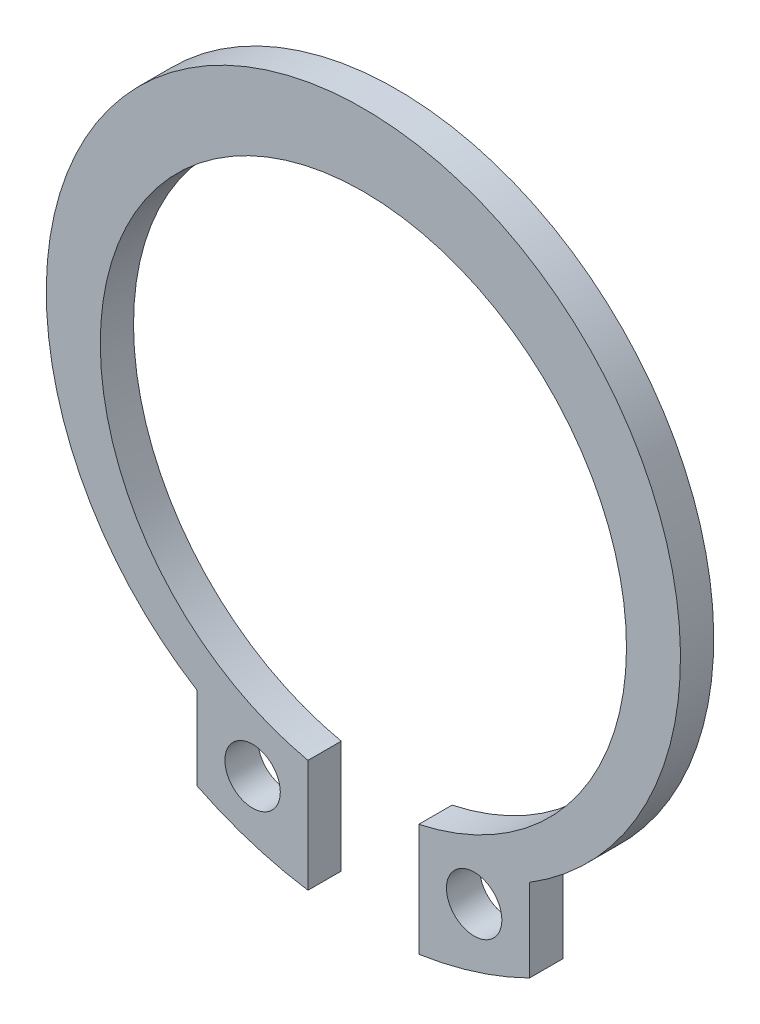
ISO-10303-21;
HEADER;
FILE_DESCRIPTION(('STEP AP214'),'2;1');
FILE_NAME('part.step','',(''),(''),'','','');
FILE_SCHEMA(('AUTOMOTIVE_DESIGN { 1 0 10303 214 1 1 1 1 }'));
ENDSEC;
DATA;
#1=APPLICATION_CONTEXT('core data for automotive mechanical design processes');
#2=APPLICATION_PROTOCOL_DEFINITION('international standard','automotive_design',2000,#1);
#3=PRODUCT_CONTEXT('',#1,'mechanical');
#4=PRODUCT('Part','Part','',(#3));
#5=PRODUCT_RELATED_PRODUCT_CATEGORY('part','',(#4));
#6=PRODUCT_DEFINITION_FORMATION('','',#4);
#7=PRODUCT_DEFINITION_CONTEXT('part definition',#1,'design');
#8=PRODUCT_DEFINITION('design','',#6,#7);
#9=PRODUCT_DEFINITION_SHAPE('','',#8);
#10=(LENGTH_UNIT() NAMED_UNIT(*) SI_UNIT(.MILLI.,.METRE.));
#11=(NAMED_UNIT(*) PLANE_ANGLE_UNIT() SI_UNIT($,.RADIAN.));
#12=(NAMED_UNIT(*) SI_UNIT($,.STERADIAN.) SOLID_ANGLE_UNIT());
#13=UNCERTAINTY_MEASURE_WITH_UNIT(LENGTH_MEASURE(1.E-05),#10,'distance_accuracy_value','');
#14=(GEOMETRIC_REPRESENTATION_CONTEXT(3) GLOBAL_UNCERTAINTY_ASSIGNED_CONTEXT((#13)) GLOBAL_UNIT_ASSIGNED_CONTEXT((#10,
#11,#12)) REPRESENTATION_CONTEXT('',''));
#15=CARTESIAN_POINT('',(0.,0.,0.));
#16=DIRECTION('',(0.,0.,1.));
#17=DIRECTION('',(1.,0.,0.));
#18=AXIS2_PLACEMENT_3D('',#15,#16,#17);
#19=CARTESIAN_POINT('',(-4.,-10.7819293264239,35.4368941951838));
#20=DIRECTION('',(0.,0.,-1.));
#21=DIRECTION('',(-1.,0.,0.));
#22=AXIS2_PLACEMENT_3D('',#19,#20,#21);
#23=CYLINDRICAL_SURFACE('',#22,1.);
#24=CARTESIAN_POINT('',(-4.,-10.7819293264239,0.));
#25=DIRECTION('',(0.,0.,1.));
#26=DIRECTION('',(1.,0.,0.));
#27=AXIS2_PLACEMENT_3D('',#24,#25,#26);
#28=CIRCLE('',#27,1.);
#29=CARTESIAN_POINT('',(-3.,-10.7819293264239,0.));
#30=VERTEX_POINT('',#29);
#31=EDGE_CURVE('E141',#30,#30,#28,.T.);
#32=ORIENTED_EDGE('',*,*,#31,.F.);
#33=EDGE_LOOP('',(#32));
#34=FACE_BOUND('',#33,.T.);
#35=CARTESIAN_POINT('',(-4.,-10.7819293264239,1.2));
#36=DIRECTION('',(0.,0.,1.));
#37=DIRECTION('',(1.,0.,0.));
#38=AXIS2_PLACEMENT_3D('',#35,#36,#37);
#39=CIRCLE('',#38,1.);
#40=CARTESIAN_POINT('',(-3.,-10.7819293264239,1.2));
#41=VERTEX_POINT('',#40);
#42=EDGE_CURVE('E121',#41,#41,#39,.T.);
#43=ORIENTED_EDGE('',*,*,#42,.T.);
#44=EDGE_LOOP('',(#43));
#45=FACE_BOUND('',#44,.T.);
#46=ADVANCED_FACE('F36',(#34,#45),#23,.F.);
#47=CARTESIAN_POINT('',(-2.,-13.3510299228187,35.4368941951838));
#48=DIRECTION('',(-1.,0.,0.));
#49=DIRECTION('',(0.,-1.,0.));
#50=AXIS2_PLACEMENT_3D('',#47,#48,#49);
#51=PLANE('',#50);
#52=DIRECTION('',(0.,1.,0.));
#53=VECTOR('',#52,1.);
#54=CARTESIAN_POINT('',(-2.,-13.3510299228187,1.2));
#55=LINE('',#54,#53);
#56=CARTESIAN_POINT('',(-2.,-13.3510299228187,1.2));
#57=VERTEX_POINT('',#56);
#58=CARTESIAN_POINT('',(-2.,-9.28708781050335,1.2));
#59=VERTEX_POINT('',#58);
#60=EDGE_CURVE('E105',#57,#59,#55,.T.);
#61=ORIENTED_EDGE('',*,*,#60,.F.);
#62=DIRECTION('',(0.,0.,-1.));
#63=VECTOR('',#62,1.);
#64=CARTESIAN_POINT('',(-2.,-13.3510299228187,35.4368941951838));
#65=LINE('',#64,#63);
#66=CARTESIAN_POINT('',(-2.,-13.3510299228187,0.));
#67=VERTEX_POINT('',#66);
#68=EDGE_CURVE('E52',#57,#67,#65,.T.);
#69=ORIENTED_EDGE('',*,*,#68,.T.);
#70=DIRECTION('',(0.,1.,0.));
#71=VECTOR('',#70,1.);
#72=CARTESIAN_POINT('',(-2.,-13.3510299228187,0.));
#73=LINE('',#72,#71);
#74=CARTESIAN_POINT('',(-2.,-9.28708781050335,0.));
#75=VERTEX_POINT('',#74);
#76=EDGE_CURVE('E108',#67,#75,#73,.T.);
#77=ORIENTED_EDGE('',*,*,#76,.T.);
#78=DIRECTION('',(0.,0.,-1.));
#79=VECTOR('',#78,1.);
#80=CARTESIAN_POINT('',(-2.,-9.28708781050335,35.4368941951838));
#81=LINE('',#80,#79);
#82=EDGE_CURVE('E101',#59,#75,#81,.T.);
#83=ORIENTED_EDGE('',*,*,#82,.F.);
#84=EDGE_LOOP('',(#61,#69,#77,#83));
#85=FACE_BOUND('',#84,.T.);
#86=ADVANCED_FACE('F103',(#85),#51,.F.);
#87=CARTESIAN_POINT('',(0.,0.,35.4368941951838));
#88=DIRECTION('',(0.,0.,-1.));
#89=DIRECTION('',(-1.,0.,0.));
#90=AXIS2_PLACEMENT_3D('',#87,#88,#89);
#91=CYLINDRICAL_SURFACE('',#90,13.5);
#92=CARTESIAN_POINT('',(0.,0.,1.2));
#93=DIRECTION('',(0.,0.,1.));
#94=DIRECTION('',(1.,0.,0.));
#95=AXIS2_PLACEMENT_3D('',#92,#93,#94);
#96=CIRCLE('',#95,13.5);
#97=CARTESIAN_POINT('',(-6.,-12.0933866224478,1.2));
#98=VERTEX_POINT('',#97);
#99=EDGE_CURVE('E120',#98,#57,#96,.T.);
#100=ORIENTED_EDGE('',*,*,#99,.F.);
#101=DIRECTION('',(0.,0.,-1.));
#102=VECTOR('',#101,1.);
#103=CARTESIAN_POINT('',(-6.,-12.0933866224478,35.4368941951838));
#104=LINE('',#103,#102);
#105=CARTESIAN_POINT('',(-6.,-12.0933866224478,0.));
#106=VERTEX_POINT('',#105);
#107=EDGE_CURVE('E165',#98,#106,#104,.T.);
#108=ORIENTED_EDGE('',*,*,#107,.T.);
#109=CARTESIAN_POINT('',(0.,0.,0.));
#110=DIRECTION('',(0.,0.,1.));
#111=DIRECTION('',(1.,0.,0.));
#112=AXIS2_PLACEMENT_3D('',#109,#110,#111);
#113=CIRCLE('',#112,13.5);
#114=EDGE_CURVE('E161',#106,#67,#113,.T.);
#115=ORIENTED_EDGE('',*,*,#114,.T.);
#116=ORIENTED_EDGE('',*,*,#68,.F.);
#117=EDGE_LOOP('',(#100,#108,#115,#116));
#118=FACE_BOUND('',#117,.T.);
#119=ADVANCED_FACE('F195',(#118),#91,.T.);
#120=CARTESIAN_POINT('',(-6.,-9.10205106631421,35.4368941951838));
#121=DIRECTION('',(1.,0.,0.));
#122=DIRECTION('',(0.,0.,-1.));
#123=AXIS2_PLACEMENT_3D('',#120,#121,#122);
#124=PLANE('',#123);
#125=DIRECTION('',(0.,-1.,0.));
#126=VECTOR('',#125,1.);
#127=CARTESIAN_POINT('',(-6.,-9.10205106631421,1.2));
#128=LINE('',#127,#126);
#129=CARTESIAN_POINT('',(-6.,-9.10205106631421,1.2));
#130=VERTEX_POINT('',#129);
#131=EDGE_CURVE('E123',#130,#98,#128,.T.);
#132=ORIENTED_EDGE('',*,*,#131,.F.);
#133=DIRECTION('',(0.,0.,-1.));
#134=VECTOR('',#133,1.);
#135=CARTESIAN_POINT('',(-6.,-9.10205106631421,35.4368941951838));
#136=LINE('',#135,#134);
#137=CARTESIAN_POINT('',(-6.,-9.10205106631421,0.));
#138=VERTEX_POINT('',#137);
#139=EDGE_CURVE('E167',#130,#138,#136,.T.);
#140=ORIENTED_EDGE('',*,*,#139,.T.);
#141=DIRECTION('',(0.,-1.,0.));
#142=VECTOR('',#141,1.);
#143=CARTESIAN_POINT('',(-6.,-9.10205106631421,0.));
#144=LINE('',#143,#142);
#145=EDGE_CURVE('E158',#138,#106,#144,.T.);
#146=ORIENTED_EDGE('',*,*,#145,.T.);
#147=ORIENTED_EDGE('',*,*,#107,.F.);
#148=EDGE_LOOP('',(#132,#140,#146,#147));
#149=FACE_BOUND('',#148,.T.);
#150=ADVANCED_FACE('F192',(#149),#124,.F.);
#151=CARTESIAN_POINT('',(0.,0.65,35.4368941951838));
#152=DIRECTION('',(0.,0.,-1.));
#153=DIRECTION('',(-1.,0.,0.));
#154=AXIS2_PLACEMENT_3D('',#151,#152,#153);
#155=CYLINDRICAL_SURFACE('',#154,11.45);
#156=CARTESIAN_POINT('',(0.,0.65,1.2));
#157=DIRECTION('',(0.,0.,1.));
#158=DIRECTION('',(1.,0.,0.));
#159=AXIS2_PLACEMENT_3D('',#156,#157,#158);
#160=CIRCLE('',#159,11.45);
#161=CARTESIAN_POINT('',(6.,-9.1020510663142,1.2));
#162=VERTEX_POINT('',#161);
#163=EDGE_CURVE('E129',#162,#130,#160,.T.);
#164=ORIENTED_EDGE('',*,*,#163,.F.);
#165=DIRECTION('',(0.,0.,-1.));
#166=VECTOR('',#165,1.);
#167=CARTESIAN_POINT('',(6.,-9.1020510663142,35.4368941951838));
#168=LINE('',#167,#166);
#169=CARTESIAN_POINT('',(6.,-9.1020510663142,0.));
#170=VERTEX_POINT('',#169);
#171=EDGE_CURVE('E169',#162,#170,#168,.T.);
#172=ORIENTED_EDGE('',*,*,#171,.T.);
#173=CARTESIAN_POINT('',(0.,0.65,0.));
#174=DIRECTION('',(0.,0.,1.));
#175=DIRECTION('',(1.,0.,0.));
#176=AXIS2_PLACEMENT_3D('',#173,#174,#175);
#177=CIRCLE('',#176,11.45);
#178=EDGE_CURVE('E155',#170,#138,#177,.T.);
#179=ORIENTED_EDGE('',*,*,#178,.T.);
#180=ORIENTED_EDGE('',*,*,#139,.F.);
#181=EDGE_LOOP('',(#164,#172,#179,#180));
#182=FACE_BOUND('',#181,.T.);
#183=ADVANCED_FACE('F190',(#182),#155,.T.);
#184=CARTESIAN_POINT('',(6.,-12.0933866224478,35.4368941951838));
#185=DIRECTION('',(-1.,0.,0.));
#186=DIRECTION('',(0.,-1.,0.));
#187=AXIS2_PLACEMENT_3D('',#184,#185,#186);
#188=PLANE('',#187);
#189=DIRECTION('',(0.,1.,0.));
#190=VECTOR('',#189,1.);
#191=CARTESIAN_POINT('',(6.,-12.0933866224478,1.2));
#192=LINE('',#191,#190);
#193=CARTESIAN_POINT('',(6.,-12.0933866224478,1.2));
#194=VERTEX_POINT('',#193);
#195=EDGE_CURVE('E132',#194,#162,#192,.T.);
#196=ORIENTED_EDGE('',*,*,#195,.F.);
#197=DIRECTION('',(0.,0.,-1.));
#198=VECTOR('',#197,1.);
#199=CARTESIAN_POINT('',(6.,-12.0933866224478,35.4368941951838));
#200=LINE('',#199,#198);
#201=CARTESIAN_POINT('',(6.,-12.0933866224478,0.));
#202=VERTEX_POINT('',#201);
#203=EDGE_CURVE('E171',#194,#202,#200,.T.);
#204=ORIENTED_EDGE('',*,*,#203,.T.);
#205=DIRECTION('',(0.,1.,0.));
#206=VECTOR('',#205,1.);
#207=CARTESIAN_POINT('',(6.,-12.0933866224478,0.));
#208=LINE('',#207,#206);
#209=EDGE_CURVE('E152',#202,#170,#208,.T.);
#210=ORIENTED_EDGE('',*,*,#209,.T.);
#211=ORIENTED_EDGE('',*,*,#171,.F.);
#212=EDGE_LOOP('',(#196,#204,#210,#211));
#213=FACE_BOUND('',#212,.T.);
#214=ADVANCED_FACE('F187',(#213),#188,.F.);
#215=CARTESIAN_POINT('',(0.,0.,35.4368941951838));
#216=DIRECTION('',(0.,0.,-1.));
#217=DIRECTION('',(-1.,0.,0.));
#218=AXIS2_PLACEMENT_3D('',#215,#216,#217);
#219=CYLINDRICAL_SURFACE('',#218,13.5);
#220=CARTESIAN_POINT('',(0.,0.,1.2));
#221=DIRECTION('',(0.,0.,1.));
#222=DIRECTION('',(1.,0.,0.));
#223=AXIS2_PLACEMENT_3D('',#220,#221,#222);
#224=CIRCLE('',#223,13.5);
#225=CARTESIAN_POINT('',(2.,-13.3510299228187,1.2));
#226=VERTEX_POINT('',#225);
#227=EDGE_CURVE('E135',#226,#194,#224,.T.);
#228=ORIENTED_EDGE('',*,*,#227,.F.);
#229=DIRECTION('',(0.,0.,-1.));
#230=VECTOR('',#229,1.);
#231=CARTESIAN_POINT('',(2.,-13.3510299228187,35.4368941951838));
#232=LINE('',#231,#230);
#233=CARTESIAN_POINT('',(2.,-13.3510299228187,0.));
#234=VERTEX_POINT('',#233);
#235=EDGE_CURVE('E45',#226,#234,#232,.T.);
#236=ORIENTED_EDGE('',*,*,#235,.T.);
#237=CARTESIAN_POINT('',(0.,0.,0.));
#238=DIRECTION('',(0.,0.,1.));
#239=DIRECTION('',(1.,0.,0.));
#240=AXIS2_PLACEMENT_3D('',#237,#238,#239);
#241=CIRCLE('',#240,13.5);
#242=EDGE_CURVE('E149',#234,#202,#241,.T.);
#243=ORIENTED_EDGE('',*,*,#242,.T.);
#244=ORIENTED_EDGE('',*,*,#203,.F.);
#245=EDGE_LOOP('',(#228,#236,#243,#244));
#246=FACE_BOUND('',#245,.T.);
#247=ADVANCED_FACE('F174',(#246),#219,.T.);
#248=CARTESIAN_POINT('',(2.,-9.28708781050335,35.4368941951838));
#249=DIRECTION('',(1.,0.,0.));
#250=DIRECTION('',(0.,1.,0.));
#251=AXIS2_PLACEMENT_3D('',#248,#249,#250);
#252=PLANE('',#251);
#253=DIRECTION('',(0.,-1.,0.));
#254=VECTOR('',#253,1.);
#255=CARTESIAN_POINT('',(2.,-9.28708781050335,1.2));
#256=LINE('',#255,#254);
#257=CARTESIAN_POINT('',(2.,-9.28708781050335,1.2));
#258=VERTEX_POINT('',#257);
#259=EDGE_CURVE('E59',#258,#226,#256,.T.);
#260=ORIENTED_EDGE('',*,*,#259,.F.);
#261=DIRECTION('',(0.,0.,-1.));
#262=VECTOR('',#261,1.);
#263=CARTESIAN_POINT('',(2.,-9.28708781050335,35.4368941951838));
#264=LINE('',#263,#262);
#265=CARTESIAN_POINT('',(2.,-9.28708781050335,0.));
#266=VERTEX_POINT('',#265);
#267=EDGE_CURVE('E11',#258,#266,#264,.T.);
#268=ORIENTED_EDGE('',*,*,#267,.T.);
#269=DIRECTION('',(0.,-1.,0.));
#270=VECTOR('',#269,1.);
#271=CARTESIAN_POINT('',(2.,-9.28708781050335,0.));
#272=LINE('',#271,#270);
#273=EDGE_CURVE('E146',#266,#234,#272,.T.);
#274=ORIENTED_EDGE('',*,*,#273,.T.);
#275=ORIENTED_EDGE('',*,*,#235,.F.);
#276=EDGE_LOOP('',(#260,#268,#274,#275));
#277=FACE_BOUND('',#276,.T.);
#278=ADVANCED_FACE('F179',(#277),#252,.F.);
#279=CARTESIAN_POINT('',(0.,0.,35.4368941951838));
#280=DIRECTION('',(0.,0.,-1.));
#281=DIRECTION('',(-1.,0.,0.));
#282=AXIS2_PLACEMENT_3D('',#279,#280,#281);
#283=CYLINDRICAL_SURFACE('',#282,9.5);
#284=CARTESIAN_POINT('',(0.,0.,1.2));
#285=DIRECTION('',(0.,0.,1.));
#286=DIRECTION('',(1.,0.,0.));
#287=AXIS2_PLACEMENT_3D('',#284,#285,#286);
#288=CIRCLE('',#287,9.5);
#289=EDGE_CURVE('E114',#59,#258,#288,.F.);
#290=ORIENTED_EDGE('',*,*,#289,.F.);
#291=ORIENTED_EDGE('',*,*,#82,.T.);
#292=CARTESIAN_POINT('',(0.,0.,0.));
#293=DIRECTION('',(0.,0.,-1.));
#294=DIRECTION('',(1.,0.,0.));
#295=AXIS2_PLACEMENT_3D('',#292,#293,#294);
#296=CIRCLE('',#295,9.5);
#297=EDGE_CURVE('E144',#75,#266,#296,.T.);
#298=ORIENTED_EDGE('',*,*,#297,.T.);
#299=ORIENTED_EDGE('',*,*,#267,.F.);
#300=EDGE_LOOP('',(#290,#291,#298,#299));
#301=FACE_BOUND('',#300,.T.);
#302=ADVANCED_FACE('F38',(#301),#283,.F.);
#303=CARTESIAN_POINT('',(0.,0.,0.));
#304=DIRECTION('',(0.,0.,1.));
#305=DIRECTION('',(1.,0.,0.));
#306=AXIS2_PLACEMENT_3D('',#303,#304,#305);
#307=PLANE('',#306);
#308=ORIENTED_EDGE('',*,*,#297,.F.);
#309=ORIENTED_EDGE('',*,*,#76,.F.);
#310=ORIENTED_EDGE('',*,*,#114,.F.);
#311=ORIENTED_EDGE('',*,*,#145,.F.);
#312=ORIENTED_EDGE('',*,*,#178,.F.);
#313=ORIENTED_EDGE('',*,*,#209,.F.);
#314=ORIENTED_EDGE('',*,*,#242,.F.);
#315=ORIENTED_EDGE('',*,*,#273,.F.);
#316=EDGE_LOOP('',(#308,#309,#310,#311,#312,#313,#314,#315));
#317=FACE_BOUND('',#316,.T.);
#318=ORIENTED_EDGE('',*,*,#31,.T.);
#319=EDGE_LOOP('',(#318));
#320=FACE_BOUND('',#319,.T.);
#321=CARTESIAN_POINT('',(4.,-10.7819293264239,0.));
#322=DIRECTION('',(0.,0.,1.));
#323=DIRECTION('',(1.,0.,0.));
#324=AXIS2_PLACEMENT_3D('',#321,#322,#323);
#325=CIRCLE('',#324,1.);
#326=CARTESIAN_POINT('',(5.,-10.7819293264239,0.));
#327=VERTEX_POINT('',#326);
#328=EDGE_CURVE('E116',#327,#327,#325,.T.);
#329=ORIENTED_EDGE('',*,*,#328,.T.);
#330=EDGE_LOOP('',(#329));
#331=FACE_BOUND('',#330,.T.);
#332=ADVANCED_FACE('F181',(#317,#320,#331),#307,.F.);
#333=CARTESIAN_POINT('',(4.,-10.7819293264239,35.4368941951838));
#334=DIRECTION('',(0.,0.,-1.));
#335=DIRECTION('',(-1.,0.,0.));
#336=AXIS2_PLACEMENT_3D('',#333,#334,#335);
#337=CYLINDRICAL_SURFACE('',#336,1.);
#338=ORIENTED_EDGE('',*,*,#328,.F.);
#339=EDGE_LOOP('',(#338));
#340=FACE_BOUND('',#339,.T.);
#341=CARTESIAN_POINT('',(4.,-10.7819293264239,1.2));
#342=DIRECTION('',(0.,0.,1.));
#343=DIRECTION('',(1.,0.,0.));
#344=AXIS2_PLACEMENT_3D('',#341,#342,#343);
#345=CIRCLE('',#344,1.);
#346=CARTESIAN_POINT('',(5.,-10.7819293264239,1.2));
#347=VERTEX_POINT('',#346);
#348=EDGE_CURVE('E40',#347,#347,#345,.T.);
#349=ORIENTED_EDGE('',*,*,#348,.T.);
#350=EDGE_LOOP('',(#349));
#351=FACE_BOUND('',#350,.T.);
#352=ADVANCED_FACE('F213',(#340,#351),#337,.F.);
#353=CARTESIAN_POINT('',(0.,0.,1.2));
#354=DIRECTION('',(0.,0.,1.));
#355=DIRECTION('',(1.,0.,0.));
#356=AXIS2_PLACEMENT_3D('',#353,#354,#355);
#357=PLANE('',#356);
#358=ORIENTED_EDGE('',*,*,#348,.F.);
#359=EDGE_LOOP('',(#358));
#360=FACE_BOUND('',#359,.T.);
#361=ORIENTED_EDGE('',*,*,#42,.F.);
#362=EDGE_LOOP('',(#361));
#363=FACE_BOUND('',#362,.T.);
#364=ORIENTED_EDGE('',*,*,#60,.T.);
#365=ORIENTED_EDGE('',*,*,#289,.T.);
#366=ORIENTED_EDGE('',*,*,#259,.T.);
#367=ORIENTED_EDGE('',*,*,#227,.T.);
#368=ORIENTED_EDGE('',*,*,#195,.T.);
#369=ORIENTED_EDGE('',*,*,#163,.T.);
#370=ORIENTED_EDGE('',*,*,#131,.T.);
#371=ORIENTED_EDGE('',*,*,#99,.T.);
#372=EDGE_LOOP('',(#364,#365,#366,#367,#368,#369,#370,#371));
#373=FACE_BOUND('',#372,.T.);
#374=ADVANCED_FACE('F118',(#360,#363,#373),#357,.T.);
#375=CLOSED_SHELL('',(#46,#86,#119,#150,#183,#214,#247,#278,#302,#332,#352,#374));
#376=MANIFOLD_SOLID_BREP('B2',#375);
#377=ADVANCED_BREP_SHAPE_REPRESENTATION('',(#18,#376),#14);
#378=SHAPE_DEFINITION_REPRESENTATION(#9,#377);
ENDSEC;
END-ISO-10303-21;
